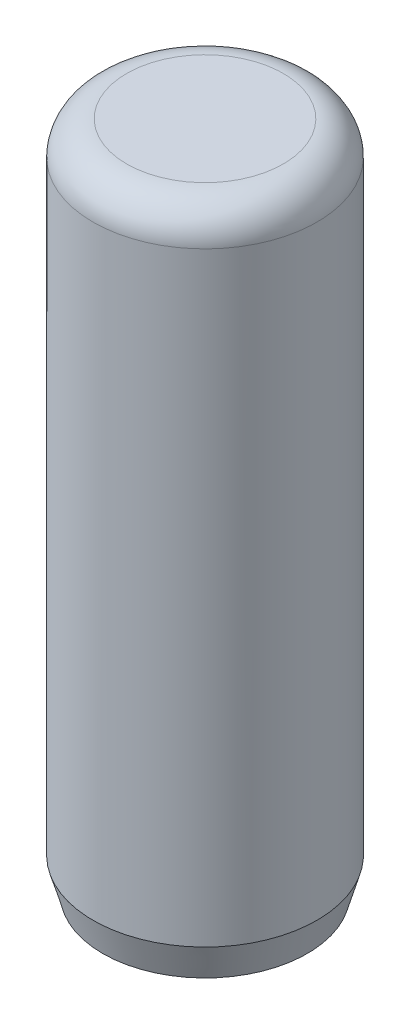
from build123d import *

# Parameters (mm, degrees)
SKETCH1_W      = 6.35
SKETCH1_H      = 38.1
FILLET1_R      = 1.905
CHAMFER1_SIZE  = 1.905
CHAMFER1_SIZE2 = 0.54624996


with BuildPart() as part:
    # Sketch1 → Base-Revolve (revolve)
    with BuildSketch(Plane.XY, mode=Mode.PRIVATE) as base_revolve_sk:
        with Locations((3.175, 19.05)):
            Rectangle(SKETCH1_W, SKETCH1_H)
    revolve(base_revolve_sk.sketch.rotate(Axis((0, 0, 0), (0, 1, 0)), 90), axis=Axis((0, 0, 0), (0, 1, 0)))

    # Fillet1
    fillet1_edges = [part.edges().sort_by_distance(p)[0] for p in [
        (0, 38.1, 6.35),
    ]]
    fillet(fillet1_edges, radius=FILLET1_R)

    # Chamfer1
    chamfer1_edges = [part.edges().sort_by_distance(p)[0] for p in [
        (0, 0, 6.35),
    ]]
    chamfer1_side = [part.faces().sort_by_distance(p)[0] for p in [
        (0, 18.0975, 6.35),
    ]]
    chamfer(chamfer1_edges, length=CHAMFER1_SIZE, length2=CHAMFER1_SIZE2, reference=chamfer1_side[0])


solid = part.part
